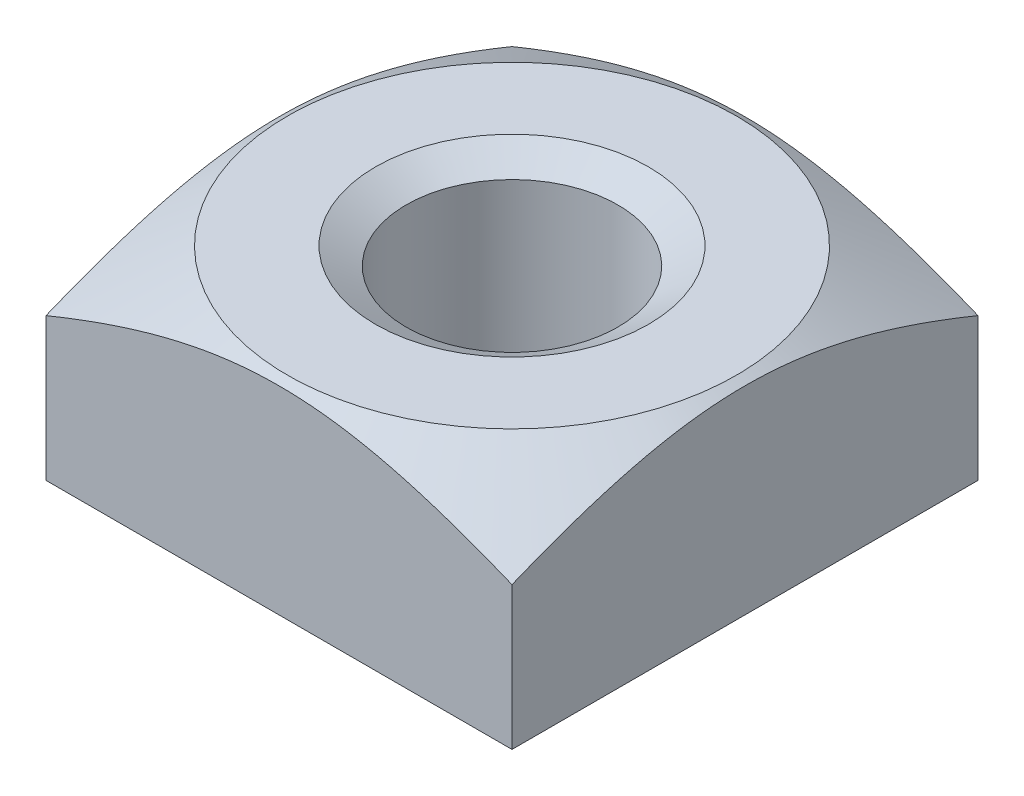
from build123d import *

# Parameters (mm, degrees)
BASENUTSKE_W     = 5.5
BASENUTSKE_H     = 5.5
BASENUT_DEPTH    = 2.4
HOLESKE_R        = 1.25
TAPPEDHOLE_DEPTH = 5.570010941
CHAMFER1_SIZE    = 0.208333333
CHAMFER1_SIZE2   = 0.360843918


with BuildPart() as part:
    # BaseNutSke → Basenut (new body)
    with BuildSketch(Plane(origin=(0, 0, 0), x_dir=(1, 0, 0), z_dir=(0, 1, 0))):
        Rectangle(BASENUTSKE_W, BASENUTSKE_H)
    extrude(amount=BASENUT_DEPTH)

    # CutNutSke → CutNut (revolve, cut)
    with BuildSketch(Plane.XY, mode=Mode.PRIVATE) as cutnut_sk:
        Polygon((2.65, 2.4), (6.806921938, 2.4), (6.806921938, 0), align=None)
    revolve(cutnut_sk.sketch.rotate(Axis((0, 0, 0), (0, 1, 0)), 90), axis=Axis((0, 0, 0), (0, 1, 0)), mode=Mode.SUBTRACT)

    # HoleSke → TappedHole (cut, through all)
    with BuildSketch(Plane(origin=(0, 0, 0), x_dir=(1, 0, 0), z_dir=(0, 1, 0))):
        with Locations(Location((0, 0, 0), (0, 0, 270))):
            Circle(HOLESKE_R)
    extrude(amount=TAPPEDHOLE_DEPTH, mode=Mode.SUBTRACT)

    # Chamfer1
    chamfer1_edges = [part.edges().sort_by_distance(p)[0] for p in [
        (0, 0, -1.25),
        (0, 2.4, -1.25),
    ]]
    chamfer1_side = [part.faces().sort_by_distance(p)[0] for p in [
        (0, 1.2, -1.25),
    ]]
    chamfer(chamfer1_edges, length=CHAMFER1_SIZE, length2=CHAMFER1_SIZE2, reference=chamfer1_side[0])


solid = part.part
